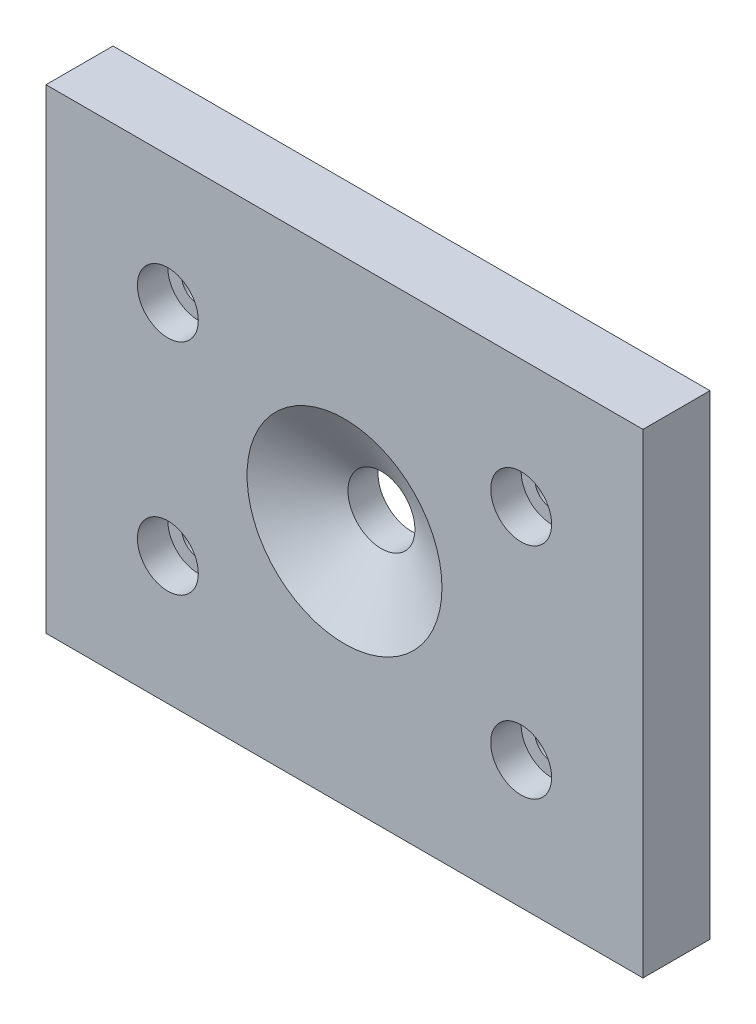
from build123d import *

# Parameters (mm, degrees)
ESQUISSE1_W                                     = 98
ESQUISSE1_H                                     = 78
EXTRUSION1_DEPTH                                = 11
CHAMBRAGE_POUR_VIS_T_TE_CYLINDRIQUE_D           = 5.5
CHAMBRAGE_POUR_VIS_T_TE_CYLINDRIQUE_CBORE_D     = 10
CHAMBRAGE_POUR_VIS_T_TE_CYLINDRIQUE_CBORE_DEPTH = 5
ESQUISSE5_R                                     = 5.5
ENL_V_MAT_EXTRU_1_DEPTH                         = 64.584589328


with BuildPart() as part:
    # Esquisse1 → Extrusion1 (new body)
    with BuildSketch(Plane.XY):
        Rectangle(ESQUISSE1_W, ESQUISSE1_H)
    extrude(amount=EXTRUSION1_DEPTH)

    # Chambrage pour vis _ t_te cylindrique (through all)
    with Locations(Plane.XY.offset(11)):
        with Locations((-29, 18), (29, 18), (29, -18), (-29, -18)):
            CounterBoreHole(CHAMBRAGE_POUR_VIS_T_TE_CYLINDRIQUE_D / 2, CHAMBRAGE_POUR_VIS_T_TE_CYLINDRIQUE_CBORE_D / 2, CHAMBRAGE_POUR_VIS_T_TE_CYLINDRIQUE_CBORE_DEPTH)

    # Esquisse5 → Enl_v. mat.-Extru.1 (cut, through all)
    with BuildSketch(Plane.XY.offset(11)):
        Circle(ESQUISSE5_R)
    extrude(amount=-ENL_V_MAT_EXTRU_1_DEPTH, mode=Mode.SUBTRACT)

    # Enl_v. mat.-Extru.2 cone 1 section (on through the dimple's axis) → Enl_v. mat.-Extru.2 (revolve, cut)
    with BuildSketch(Plane(origin=(0, 0, 11), x_dir=(0, -1, 0), z_dir=(1, 0, 0))):
        Polygon((0, 0), (16, 0), (0, 9.237604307), align=None)
    revolve(axis=Axis((0, 0, 11), (0, 0, -1)), mode=Mode.SUBTRACT)


solid = part.part
